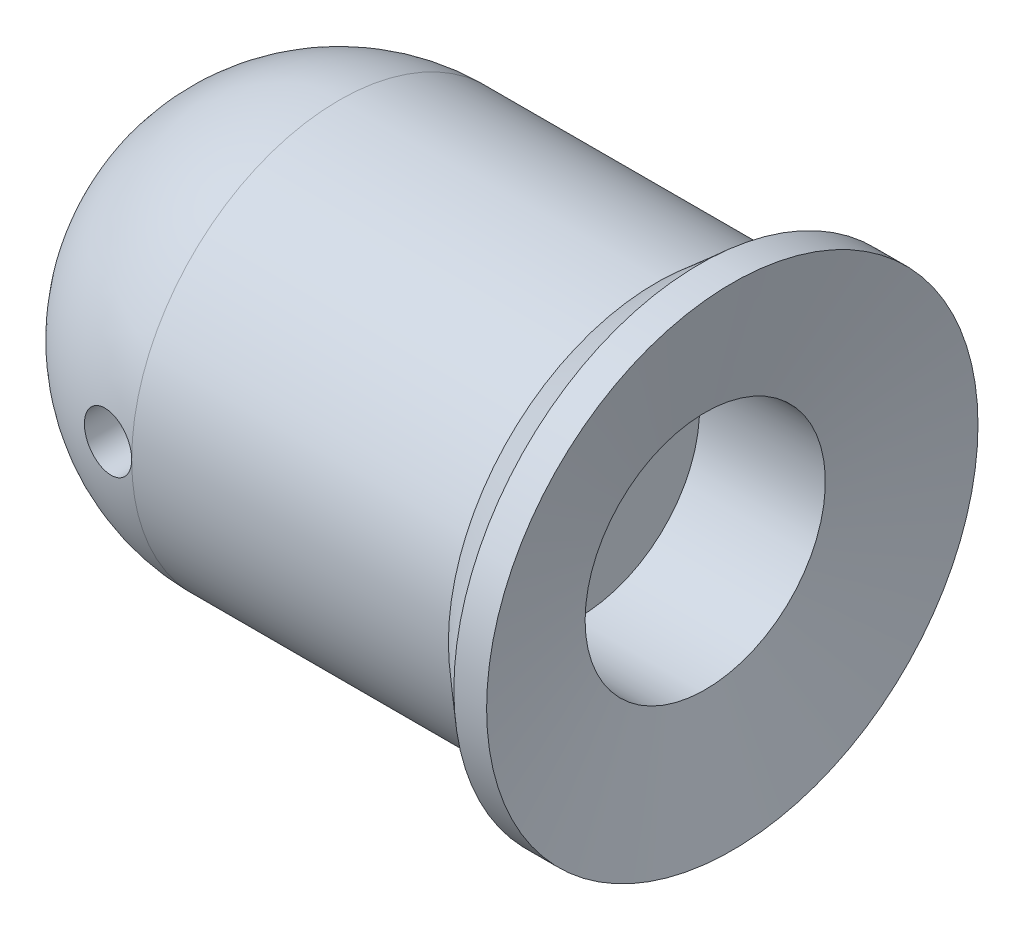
ISO-10303-21;
HEADER;
FILE_DESCRIPTION(('STEP AP214'),'2;1');
FILE_NAME('part.step','',(''),(''),'','','');
FILE_SCHEMA(('AUTOMOTIVE_DESIGN { 1 0 10303 214 1 1 1 1 }'));
ENDSEC;
DATA;
#1=APPLICATION_CONTEXT('core data for automotive mechanical design processes');
#2=APPLICATION_PROTOCOL_DEFINITION('international standard','automotive_design',2000,#1);
#3=PRODUCT_CONTEXT('',#1,'mechanical');
#4=PRODUCT('Part','Part','',(#3));
#5=PRODUCT_RELATED_PRODUCT_CATEGORY('part','',(#4));
#6=PRODUCT_DEFINITION_FORMATION('','',#4);
#7=PRODUCT_DEFINITION_CONTEXT('part definition',#1,'design');
#8=PRODUCT_DEFINITION('design','',#6,#7);
#9=PRODUCT_DEFINITION_SHAPE('','',#8);
#10=(LENGTH_UNIT() NAMED_UNIT(*) SI_UNIT(.MILLI.,.METRE.));
#11=(NAMED_UNIT(*) PLANE_ANGLE_UNIT() SI_UNIT($,.RADIAN.));
#12=(NAMED_UNIT(*) SI_UNIT($,.STERADIAN.) SOLID_ANGLE_UNIT());
#13=UNCERTAINTY_MEASURE_WITH_UNIT(LENGTH_MEASURE(1.E-05),#10,'distance_accuracy_value','');
#14=(GEOMETRIC_REPRESENTATION_CONTEXT(3) GLOBAL_UNCERTAINTY_ASSIGNED_CONTEXT((#13)) GLOBAL_UNIT_ASSIGNED_CONTEXT((#10,
#11,#12)) REPRESENTATION_CONTEXT('',''));
#15=CARTESIAN_POINT('',(0.,0.,0.));
#16=DIRECTION('',(0.,0.,1.));
#17=DIRECTION('',(1.,0.,0.));
#18=AXIS2_PLACEMENT_3D('',#15,#16,#17);
#19=CARTESIAN_POINT('',(0.,0.,0.));
#20=DIRECTION('',(-1.,0.,0.));
#21=DIRECTION('',(0.,1.,0.));
#22=AXIS2_PLACEMENT_3D('',#19,#20,#21);
#23=SPHERICAL_SURFACE('',#22,19.);
#24=CARTESIAN_POINT('',(0.,0.,0.));
#25=DIRECTION('',(-1.,0.,0.));
#26=DIRECTION('',(0.,0.,1.));
#27=AXIS2_PLACEMENT_3D('',#24,#25,#26);
#28=CIRCLE('',#27,19.);
#29=CARTESIAN_POINT('',(0.,0.,19.));
#30=VERTEX_POINT('',#29);
#31=CARTESIAN_POINT('',(0.,0.,-19.));
#32=VERTEX_POINT('',#31);
#33=EDGE_CURVE('E103',#30,#32,#28,.T.);
#34=ORIENTED_EDGE('',*,*,#33,.T.);
#35=CARTESIAN_POINT('',(-4.60444043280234,-1.34956676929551,-18.3841724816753));
#36=CARTESIAN_POINT('',(-4.52839424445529,-1.46813695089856,-18.3945137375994));
#37=CARTESIAN_POINT('',(-4.44229795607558,-1.5802722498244,-18.4062129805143));
#38=CARTESIAN_POINT('',(-4.25255463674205,-1.78841657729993,-18.4319665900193));
#39=CARTESIAN_POINT('',(-4.14888480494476,-1.88440432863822,-18.4460240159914));
#40=CARTESIAN_POINT('',(-3.92715390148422,-2.05742087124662,-18.476050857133));
#41=CARTESIAN_POINT('',(-3.80910520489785,-2.13446579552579,-18.492018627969));
#42=CARTESIAN_POINT('',(-3.56195909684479,-2.26758532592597,-18.5254010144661));
#43=CARTESIAN_POINT('',(-3.43286443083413,-2.32366512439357,-18.5428152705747));
#44=CARTESIAN_POINT('',(-3.16638087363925,-2.41367750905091,-18.5787087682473));
#45=CARTESIAN_POINT('',(-3.02894449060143,-2.44746709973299,-18.5971940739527));
#46=CARTESIAN_POINT('',(-2.75039506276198,-2.4914224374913,-18.6346015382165));
#47=CARTESIAN_POINT('',(-2.60928173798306,-2.50158638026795,-18.6535237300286));
#48=CARTESIAN_POINT('',(-2.3266061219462,-2.49800261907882,-18.6913704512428));
#49=CARTESIAN_POINT('',(-2.18504532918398,-2.48412989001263,-18.7102944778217));
#50=CARTESIAN_POINT('',(-1.90623298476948,-2.43259919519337,-18.7475113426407));
#51=CARTESIAN_POINT('',(-1.76898145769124,-2.39494109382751,-18.7658041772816));
#52=CARTESIAN_POINT('',(-1.50275057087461,-2.29686983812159,-18.8012382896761));
#53=CARTESIAN_POINT('',(-1.37376866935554,-2.23646371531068,-18.8183799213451));
#54=CARTESIAN_POINT('',(-1.12776084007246,-2.09454600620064,-18.8510334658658));
#55=CARTESIAN_POINT('',(-1.0107345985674,-2.01303497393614,-18.8665454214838));
#56=CARTESIAN_POINT('',(-0.792684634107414,-1.83168504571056,-18.895417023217));
#57=CARTESIAN_POINT('',(-0.691574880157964,-1.73195145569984,-18.9087882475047));
#58=CARTESIAN_POINT('',(-0.50755800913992,-1.51664965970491,-18.9331021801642));
#59=CARTESIAN_POINT('',(-0.424650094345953,-1.40108214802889,-18.9440449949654));
#60=CARTESIAN_POINT('',(-0.280131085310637,-1.15842887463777,-18.963107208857));
#61=CARTESIAN_POINT('',(-0.218347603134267,-1.03144757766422,-18.9712494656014));
#62=CARTESIAN_POINT('',(-0.116975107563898,-0.768770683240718,-18.9846034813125));
#63=CARTESIAN_POINT('',(-0.0773850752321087,-0.633075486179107,-18.9898153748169));
#64=CARTESIAN_POINT('',(-0.0218045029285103,-0.35791305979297,-18.9971311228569));
#65=CARTESIAN_POINT('',(-0.00563980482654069,-0.218481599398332,-18.9992579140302));
#66=CARTESIAN_POINT('',(0.00316333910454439,0.0611331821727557,-19.0004162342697));
#67=CARTESIAN_POINT('',(-0.00419759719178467,0.201316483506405,-18.9994478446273));
#68=CARTESIAN_POINT('',(-0.0421579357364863,0.477952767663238,-18.9944522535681));
#69=CARTESIAN_POINT('',(-0.0726778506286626,0.614416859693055,-18.9904355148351));
#70=CARTESIAN_POINT('',(-0.155953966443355,0.880255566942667,-18.979469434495));
#71=CARTESIAN_POINT('',(-0.208710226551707,1.00963016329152,-18.9725200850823));
#72=CARTESIAN_POINT('',(-0.335033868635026,1.25791992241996,-18.9558671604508));
#73=CARTESIAN_POINT('',(-0.408643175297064,1.3768133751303,-18.9461580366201));
#74=CARTESIAN_POINT('',(-0.574481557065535,1.60055342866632,-18.9242625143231));
#75=CARTESIAN_POINT('',(-0.666711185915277,1.70539961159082,-18.9120760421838));
#76=CARTESIAN_POINT('',(-0.867805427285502,1.89882370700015,-18.8854745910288));
#77=CARTESIAN_POINT('',(-0.976775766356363,1.98728973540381,-18.8710454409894));
#78=CARTESIAN_POINT('',(-1.20778486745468,2.14469540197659,-18.8404169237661));
#79=CARTESIAN_POINT('',(-1.32982420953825,2.21363417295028,-18.8242174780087));
#80=CARTESIAN_POINT('',(-1.58460942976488,2.33063852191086,-18.7903496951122));
#81=CARTESIAN_POINT('',(-1.7174369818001,2.37852300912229,-18.7726701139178));
#82=CARTESIAN_POINT('',(-1.9891391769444,2.4512859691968,-18.7364519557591));
#83=CARTESIAN_POINT('',(-2.12801407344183,2.47616347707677,-18.7179133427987));
#84=CARTESIAN_POINT('',(-2.40887022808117,2.50234279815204,-18.680364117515));
#85=CARTESIAN_POINT('',(-2.55086611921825,2.50348448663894,-18.661351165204));
#86=CARTESIAN_POINT('',(-2.83303593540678,2.481755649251,-18.6235114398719));
#87=CARTESIAN_POINT('',(-2.97320982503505,2.45888465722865,-18.6046846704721));
#88=CARTESIAN_POINT('',(-3.24805224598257,2.38967379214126,-18.5677161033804));
#89=CARTESIAN_POINT('',(-3.3827087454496,2.34328530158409,-18.5495758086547));
#90=CARTESIAN_POINT('',(-3.64234575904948,2.22827397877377,-18.5145504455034));
#91=CARTESIAN_POINT('',(-3.76732636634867,2.15965136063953,-18.4976653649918));
#92=CARTESIAN_POINT('',(-4.00354604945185,2.00235132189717,-18.4657121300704));
#93=CARTESIAN_POINT('',(-4.11483402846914,1.91374867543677,-18.4506375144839));
#94=CARTESIAN_POINT('',(-4.32093802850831,1.71880832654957,-18.4226899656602));
#95=CARTESIAN_POINT('',(-4.41575468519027,1.6124713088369,-18.4098169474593));
#96=CARTESIAN_POINT('',(-4.58540913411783,1.38597651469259,-18.386763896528));
#97=CARTESIAN_POINT('',(-4.66039969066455,1.26593527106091,-18.3765632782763));
#98=CARTESIAN_POINT('',(-4.78913822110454,1.01476908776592,-18.3590409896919));
#99=CARTESIAN_POINT('',(-4.84288812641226,0.883645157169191,-18.3517190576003));
#100=CARTESIAN_POINT('',(-4.92714799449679,0.615273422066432,-18.3402369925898));
#101=CARTESIAN_POINT('',(-4.95785829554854,0.478089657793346,-18.3360496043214));
#102=CARTESIAN_POINT('',(-4.99589010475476,0.200421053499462,-18.3308634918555));
#103=CARTESIAN_POINT('',(-5.00320656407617,0.0599355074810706,-18.3298654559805));
#104=CARTESIAN_POINT('',(-4.99424496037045,-0.219555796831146,-18.3310876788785));
#105=CARTESIAN_POINT('',(-4.97808309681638,-0.358565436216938,-18.3332920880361));
#106=CARTESIAN_POINT('',(-4.9228634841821,-0.631749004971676,-18.3408205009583));
#107=CARTESIAN_POINT('',(-4.88383390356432,-0.765928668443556,-18.3461406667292));
#108=CARTESIAN_POINT('',(-4.80355682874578,-0.975125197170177,-18.3570758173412));
#109=CARTESIAN_POINT('',(-4.76907429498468,-1.05285746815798,-18.3617715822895));
#110=CARTESIAN_POINT('',(-4.6924239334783,-1.20436063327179,-18.3722047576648));
#111=CARTESIAN_POINT('',(-4.65025613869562,-1.27813154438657,-18.3779421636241));
#112=CARTESIAN_POINT('',(-4.60444043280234,-1.34956676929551,-18.3841724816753));
#113=B_SPLINE_CURVE_WITH_KNOTS('',3,(#35,#36,#37,#38,#39,#40,#41,#42,#43,#44,#45,#46,#47,#48,
#49,#50,#51,#52,#53,#54,#55,#56,#57,#58,#59,#60,#61,#62,#63,#64,#65,#66,#67,#68,#69,#70,#71,#72,
#73,#74,#75,#76,#77,#78,#79,#80,#81,#82,#83,#84,#85,#86,#87,#88,#89,#90,#91,#92,#93,#94,#95,#96,
#97,#98,#99,#100,#101,#102,#103,#104,#105,#106,#107,#108,#109,#110,#111,#112),.UNSPECIFIED.,.T.,
.F.,(4,2,2,2,2,2,2,2,2,2,2,2,2,2,2,2,2,2,2,2,2,2,2,2,2,2,2,2,2,2,2,2,2,2,2,2,2,2,4),(0.,
0.423407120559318,0.847367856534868,1.27096625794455,1.69445967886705,2.12064412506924,
2.54686111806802,2.97530171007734,3.40374474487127,3.832055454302,4.26035492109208,
4.6862533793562,5.11213316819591,5.53444958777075,5.95674661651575,6.37588763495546,
6.79501764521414,7.21271556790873,7.63041460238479,8.04895944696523,8.4675167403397,
8.88883524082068,9.31017244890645,9.73506593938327,10.1599772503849,10.5877541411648,
11.0155393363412,11.4442125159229,11.8728815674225,12.2999722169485,12.7270463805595,
13.1507270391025,13.5743691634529,13.9942834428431,14.4142883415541,14.8322216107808,
15.2496411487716,15.5047332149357,15.7598241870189),.UNSPECIFIED.);
#114=EDGE_CURVE('E56',#32,#32,#113,.T.);
#115=ORIENTED_EDGE('',*,*,#114,.T.);
#116=EDGE_CURVE('E98',#32,#30,#28,.T.);
#117=ORIENTED_EDGE('',*,*,#116,.T.);
#118=CARTESIAN_POINT('',(-4.60444043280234,-1.34956676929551,18.3841724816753));
#119=CARTESIAN_POINT('',(-4.67958474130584,-1.23237975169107,18.37395387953));
#120=CARTESIAN_POINT('',(-4.74502260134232,-1.10873913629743,18.3650467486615));
#121=CARTESIAN_POINT('',(-4.85447395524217,-0.852034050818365,18.3501413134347));
#122=CARTESIAN_POINT('',(-4.89846369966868,-0.718959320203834,18.3441462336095));
#123=CARTESIAN_POINT('',(-4.96362835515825,-0.447257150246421,18.335263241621));
#124=CARTESIAN_POINT('',(-4.98480900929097,-0.308631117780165,18.3323745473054));
#125=CARTESIAN_POINT('',(-5.00372468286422,-0.0297940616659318,18.3297948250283));
#126=CARTESIAN_POINT('',(-5.00146526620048,0.11041657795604,18.330103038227));
#127=CARTESIAN_POINT('',(-4.97362555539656,0.388052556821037,18.3338996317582));
#128=CARTESIAN_POINT('',(-4.94811189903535,0.525484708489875,18.3373789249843));
#129=CARTESIAN_POINT('',(-4.87461801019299,0.794089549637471,18.347395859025));
#130=CARTESIAN_POINT('',(-4.82663698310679,0.925262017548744,18.3539336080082));
#131=CARTESIAN_POINT('',(-4.7095354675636,1.17786411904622,18.3698771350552));
#132=CARTESIAN_POINT('',(-4.6403818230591,1.29927809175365,18.3792874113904));
#133=CARTESIAN_POINT('',(-4.48298440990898,1.52876909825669,18.4006845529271));
#134=CARTESIAN_POINT('',(-4.39474009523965,1.63684575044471,18.412671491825));
#135=CARTESIAN_POINT('',(-4.20104380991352,1.83739358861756,18.4389520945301));
#136=CARTESIAN_POINT('',(-4.09547939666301,1.92975418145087,18.4532608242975));
#137=CARTESIAN_POINT('',(-3.87059343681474,2.09546779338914,18.4837026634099));
#138=CARTESIAN_POINT('',(-3.75127127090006,2.16881995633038,18.4998358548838));
#139=CARTESIAN_POINT('',(-3.50112170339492,2.29511635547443,18.5336094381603));
#140=CARTESIAN_POINT('',(-3.37020175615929,2.34787407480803,18.5512619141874));
#141=CARTESIAN_POINT('',(-3.10147190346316,2.43063789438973,18.5874411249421));
#142=CARTESIAN_POINT('',(-2.96366169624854,2.46064299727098,18.6059678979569));
#143=CARTESIAN_POINT('',(-2.68402640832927,2.49722963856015,18.6435034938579));
#144=CARTESIAN_POINT('',(-2.54217994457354,2.50364537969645,18.6625147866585));
#145=CARTESIAN_POINT('',(-2.25941588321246,2.49241664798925,18.70035504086));
#146=CARTESIAN_POINT('',(-2.11849830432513,2.47477169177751,18.7191839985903));
#147=CARTESIAN_POINT('',(-1.8412839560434,2.41582613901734,18.7561702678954));
#148=CARTESIAN_POINT('',(-1.70499773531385,2.37447493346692,18.7743260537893));
#149=CARTESIAN_POINT('',(-1.44127124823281,2.26919617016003,18.8094112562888));
#150=CARTESIAN_POINT('',(-1.31383088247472,2.20526886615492,18.8263406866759));
#151=CARTESIAN_POINT('',(-1.07192620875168,2.05685903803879,18.858436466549));
#152=CARTESIAN_POINT('',(-0.957417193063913,1.97245072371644,18.8736088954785));
#153=CARTESIAN_POINT('',(-0.74420562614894,1.78530232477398,18.9018298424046));
#154=CARTESIAN_POINT('',(-0.645502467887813,1.68256294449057,18.9148784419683));
#155=CARTESIAN_POINT('',(-0.467520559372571,1.46249844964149,18.9383878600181));
#156=CARTESIAN_POINT('',(-0.388099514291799,1.34529045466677,18.9488676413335));
#157=CARTESIAN_POINT('',(-0.250083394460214,1.09899914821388,18.9670679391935));
#158=CARTESIAN_POINT('',(-0.191487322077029,0.969916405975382,18.974788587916));
#159=CARTESIAN_POINT('',(-0.0972829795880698,0.70469282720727,18.9871963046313));
#160=CARTESIAN_POINT('',(-0.0614879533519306,0.56861946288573,18.991908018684));
#161=CARTESIAN_POINT('',(-0.0131933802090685,0.29233119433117,18.9982642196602));
#162=CARTESIAN_POINT('',(-0.000692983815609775,0.152116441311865,18.9999088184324));
#163=CARTESIAN_POINT('',(0.000633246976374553,-0.127663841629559,19.0000833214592));
#164=CARTESIAN_POINT('',(-0.0104130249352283,-0.267228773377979,18.9986300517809));
#165=CARTESIAN_POINT('',(-0.0555890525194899,-0.542502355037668,18.9926844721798));
#166=CARTESIAN_POINT('',(-0.0897185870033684,-0.678211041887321,18.9881921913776));
#167=CARTESIAN_POINT('',(-0.180032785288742,-0.941896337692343,18.976297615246));
#168=CARTESIAN_POINT('',(-0.236211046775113,-1.06987517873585,18.9688961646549));
#169=CARTESIAN_POINT('',(-0.368969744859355,-1.31456692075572,18.9513911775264));
#170=CARTESIAN_POINT('',(-0.445550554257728,-1.43127961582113,18.941287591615));
#171=CARTESIAN_POINT('',(-0.617314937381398,-1.65076067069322,18.918603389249));
#172=CARTESIAN_POINT('',(-0.712588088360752,-1.75345767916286,18.9060108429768));
#173=CARTESIAN_POINT('',(-0.918748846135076,-1.94141838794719,18.8787298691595));
#174=CARTESIAN_POINT('',(-1.02963710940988,-2.02668135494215,18.8640413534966));
#175=CARTESIAN_POINT('',(-1.2648330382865,-2.17809087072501,18.8328457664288));
#176=CARTESIAN_POINT('',(-1.38924185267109,-2.2440774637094,18.8163249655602));
#177=CARTESIAN_POINT('',(-1.64720737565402,-2.35423400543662,18.7820195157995));
#178=CARTESIAN_POINT('',(-1.78076451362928,-2.39840292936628,18.7642348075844));
#179=CARTESIAN_POINT('',(-2.05436685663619,-2.46401234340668,18.7277468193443));
#180=CARTESIAN_POINT('',(-2.19445500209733,-2.48527041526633,18.7090373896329));
#181=CARTESIAN_POINT('',(-2.47617126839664,-2.50386908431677,18.6713550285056));
#182=CARTESIAN_POINT('',(-2.6177993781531,-2.50120985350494,18.6523820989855));
#183=CARTESIAN_POINT('',(-2.89920929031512,-2.47198855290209,18.6146262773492));
#184=CARTESIAN_POINT('',(-3.03898082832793,-2.44532604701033,18.5958445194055));
#185=CARTESIAN_POINT('',(-3.31212644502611,-2.36866493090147,18.5590868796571));
#186=CARTESIAN_POINT('',(-3.44549892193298,-2.31866051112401,18.5411111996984));
#187=CARTESIAN_POINT('',(-3.7018654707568,-2.19673827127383,18.5065116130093));
#188=CARTESIAN_POINT('',(-3.82486784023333,-2.12483818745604,18.4898866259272));
#189=CARTESIAN_POINT('',(-4.05694096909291,-1.96113514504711,18.4584815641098));
#190=CARTESIAN_POINT('',(-4.16602867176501,-1.86935676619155,18.4436992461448));
#191=CARTESIAN_POINT('',(-4.33014913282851,-1.70547734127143,18.4214366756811));
#192=CARTESIAN_POINT('',(-4.39032028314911,-1.63852881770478,18.4132685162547));
#193=CARTESIAN_POINT('',(-4.50316161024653,-1.4984759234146,18.3979414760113));
#194=CARTESIAN_POINT('',(-4.5558318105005,-1.42537157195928,18.3907825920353));
#195=CARTESIAN_POINT('',(-4.60444043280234,-1.34956676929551,18.3841724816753));
#196=B_SPLINE_CURVE_WITH_KNOTS('',3,(#118,#119,#120,#121,#122,#123,#124,#125,#126,#127,#128,
#129,#130,#131,#132,#133,#134,#135,#136,#137,#138,#139,#140,#141,#142,#143,#144,#145,#146,#147,
#148,#149,#150,#151,#152,#153,#154,#155,#156,#157,#158,#159,#160,#161,#162,#163,#164,#165,#166,
#167,#168,#169,#170,#171,#172,#173,#174,#175,#176,#177,#178,#179,#180,#181,#182,#183,#184,#185,
#186,#187,#188,#189,#190,#191,#192,#193,#194,#195),.UNSPECIFIED.,.T.,.F.,(4,2,2,2,2,2,2,2,2,2,2,
2,2,2,2,2,2,2,2,2,2,2,2,2,2,2,2,2,2,2,2,2,2,2,2,2,2,2,4),(0.,0.418427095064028,
0.837316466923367,1.25610034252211,1.6747848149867,2.09227325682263,2.50977646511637,
2.92793685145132,3.34610919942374,3.76711234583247,4.1881344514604,4.61288573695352,
5.03765564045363,5.46540538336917,5.89316371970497,6.32183866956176,6.75050880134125,
7.177648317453,7.60477142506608,8.02863956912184,8.45248740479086,8.87281741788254,
9.29313210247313,9.71116966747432,10.1292032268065,10.547115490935,10.9650353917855,
11.3850092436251,11.8050007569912,12.2283843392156,12.651787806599,13.0785380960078,
13.5052853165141,13.9338265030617,14.3624744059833,14.7907760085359,15.2185510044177,
15.4892199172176,15.7598879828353),.UNSPECIFIED.);
#197=EDGE_CURVE('E61',#30,#30,#196,.T.);
#198=ORIENTED_EDGE('',*,*,#197,.T.);
#199=EDGE_LOOP('',(#34,#115,#117,#198));
#200=FACE_BOUND('',#199,.T.);
#201=ADVANCED_FACE('F38',(#200),#23,.T.);
#202=CARTESIAN_POINT('',(22.,11.,0.));
#203=DIRECTION('',(-1.,0.,0.));
#204=DIRECTION('',(0.,0.,1.));
#205=AXIS2_PLACEMENT_3D('',#202,#203,#204);
#206=PLANE('',#205);
#207=CARTESIAN_POINT('',(22.,0.,0.));
#208=DIRECTION('',(1.,0.,0.));
#209=DIRECTION('',(0.,0.,-1.));
#210=AXIS2_PLACEMENT_3D('',#207,#208,#209);
#211=CIRCLE('',#210,4.25);
#212=CARTESIAN_POINT('',(22.,0.,-4.25));
#213=VERTEX_POINT('',#212);
#214=EDGE_CURVE('E96',#213,#213,#211,.T.);
#215=ORIENTED_EDGE('',*,*,#214,.F.);
#216=EDGE_LOOP('',(#215));
#217=FACE_BOUND('',#216,.T.);
#218=CARTESIAN_POINT('',(22.,0.,0.));
#219=DIRECTION('',(-1.,0.,0.));
#220=DIRECTION('',(0.,0.,1.));
#221=AXIS2_PLACEMENT_3D('',#218,#219,#220);
#222=CIRCLE('',#221,11.);
#223=CARTESIAN_POINT('',(22.,0.,11.));
#224=VERTEX_POINT('',#223);
#225=EDGE_CURVE('E85',#224,#224,#222,.T.);
#226=ORIENTED_EDGE('',*,*,#225,.F.);
#227=EDGE_LOOP('',(#226));
#228=FACE_BOUND('',#227,.T.);
#229=ADVANCED_FACE('F177',(#217,#228),#206,.F.);
#230=CARTESIAN_POINT('',(0.,0.,0.));
#231=DIRECTION('',(-1.,0.,0.));
#232=DIRECTION('',(0.,0.,1.));
#233=AXIS2_PLACEMENT_3D('',#230,#231,#232);
#234=CYLINDRICAL_SURFACE('',#233,11.);
#235=CARTESIAN_POINT('',(33.52,0.,0.));
#236=DIRECTION('',(-1.,0.,0.));
#237=DIRECTION('',(0.,0.,1.));
#238=AXIS2_PLACEMENT_3D('',#235,#236,#237);
#239=CIRCLE('',#238,11.);
#240=CARTESIAN_POINT('',(33.52,0.,11.));
#241=VERTEX_POINT('',#240);
#242=EDGE_CURVE('E115',#241,#241,#239,.T.);
#243=ORIENTED_EDGE('',*,*,#242,.F.);
#244=EDGE_LOOP('',(#243));
#245=FACE_BOUND('',#244,.T.);
#246=ORIENTED_EDGE('',*,*,#225,.T.);
#247=EDGE_LOOP('',(#246));
#248=FACE_BOUND('',#247,.T.);
#249=ADVANCED_FACE('F171',(#245,#248),#234,.F.);
#250=CARTESIAN_POINT('',(33.52,0.,0.));
#251=DIRECTION('',(1.,0.,0.));
#252=DIRECTION('',(0.,0.,-1.));
#253=AXIS2_PLACEMENT_3D('',#250,#251,#252);
#254=CONICAL_SURFACE('',#253,11.,1.35839689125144);
#255=CARTESIAN_POINT('',(36.,0.,0.));
#256=DIRECTION('',(-1.,0.,0.));
#257=DIRECTION('',(0.,0.,1.));
#258=AXIS2_PLACEMENT_3D('',#255,#256,#257);
#259=CIRCLE('',#258,22.5);
#260=CARTESIAN_POINT('',(36.,0.,22.5));
#261=VERTEX_POINT('',#260);
#262=EDGE_CURVE('E112',#261,#261,#259,.T.);
#263=ORIENTED_EDGE('',*,*,#262,.F.);
#264=EDGE_LOOP('',(#263));
#265=FACE_BOUND('',#264,.T.);
#266=ORIENTED_EDGE('',*,*,#242,.T.);
#267=EDGE_LOOP('',(#266));
#268=FACE_BOUND('',#267,.T.);
#269=ADVANCED_FACE('F165',(#265,#268),#254,.F.);
#270=CARTESIAN_POINT('',(0.,0.,0.));
#271=DIRECTION('',(-1.,0.,0.));
#272=DIRECTION('',(0.,0.,1.));
#273=AXIS2_PLACEMENT_3D('',#270,#271,#272);
#274=CYLINDRICAL_SURFACE('',#273,22.5);
#275=CARTESIAN_POINT('',(33.,0.,0.));
#276=DIRECTION('',(-1.,0.,0.));
#277=DIRECTION('',(0.,0.,1.));
#278=AXIS2_PLACEMENT_3D('',#275,#276,#277);
#279=CIRCLE('',#278,22.5);
#280=CARTESIAN_POINT('',(33.,0.,22.5));
#281=VERTEX_POINT('',#280);
#282=EDGE_CURVE('E109',#281,#281,#279,.T.);
#283=ORIENTED_EDGE('',*,*,#282,.F.);
#284=EDGE_LOOP('',(#283));
#285=FACE_BOUND('',#284,.T.);
#286=ORIENTED_EDGE('',*,*,#262,.T.);
#287=EDGE_LOOP('',(#286));
#288=FACE_BOUND('',#287,.T.);
#289=ADVANCED_FACE('F159',(#285,#288),#274,.T.);
#290=CARTESIAN_POINT('',(33.,0.,0.));
#291=DIRECTION('',(1.,0.,0.));
#292=DIRECTION('',(0.,0.,-1.));
#293=AXIS2_PLACEMENT_3D('',#290,#291,#292);
#294=CONICAL_SURFACE('',#293,22.5,0.718829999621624);
#295=CARTESIAN_POINT('',(29.,0.,0.));
#296=DIRECTION('',(-1.,0.,0.));
#297=DIRECTION('',(0.,0.,1.));
#298=AXIS2_PLACEMENT_3D('',#295,#296,#297);
#299=CIRCLE('',#298,19.);
#300=CARTESIAN_POINT('',(29.,0.,19.));
#301=VERTEX_POINT('',#300);
#302=EDGE_CURVE('E106',#301,#301,#299,.T.);
#303=ORIENTED_EDGE('',*,*,#302,.F.);
#304=EDGE_LOOP('',(#303));
#305=FACE_BOUND('',#304,.T.);
#306=ORIENTED_EDGE('',*,*,#282,.T.);
#307=EDGE_LOOP('',(#306));
#308=FACE_BOUND('',#307,.T.);
#309=ADVANCED_FACE('F153',(#305,#308),#294,.T.);
#310=CARTESIAN_POINT('',(0.,0.,0.));
#311=DIRECTION('',(-1.,0.,0.));
#312=DIRECTION('',(0.,0.,1.));
#313=AXIS2_PLACEMENT_3D('',#310,#311,#312);
#314=CYLINDRICAL_SURFACE('',#313,19.);
#315=ORIENTED_EDGE('',*,*,#33,.F.);
#316=ORIENTED_EDGE('',*,*,#116,.F.);
#317=EDGE_LOOP('',(#315,#316));
#318=FACE_BOUND('',#317,.T.);
#319=ORIENTED_EDGE('',*,*,#302,.T.);
#320=EDGE_LOOP('',(#319));
#321=FACE_BOUND('',#320,.T.);
#322=ADVANCED_FACE('F150',(#318,#321),#314,.T.);
#323=CARTESIAN_POINT('',(-3.,0.,0.));
#324=DIRECTION('',(1.,0.,0.));
#325=DIRECTION('',(0.,0.,-1.));
#326=AXIS2_PLACEMENT_3D('',#323,#324,#325);
#327=CONICAL_SURFACE('',#326,4.24999999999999,1.02974425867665);
#328=CARTESIAN_POINT('',(-5.55365763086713,0.,0.));
#329=VERTEX_POINT('',#328);
#330=VERTEX_LOOP('',#329);
#331=FACE_BOUND('',#330,.T.);
#332=CARTESIAN_POINT('',(-3.,0.,0.));
#333=DIRECTION('',(1.,0.,0.));
#334=DIRECTION('',(0.,0.,-1.));
#335=AXIS2_PLACEMENT_3D('',#332,#333,#334);
#336=CIRCLE('',#335,4.24999999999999);
#337=CARTESIAN_POINT('',(-3.,2.44948974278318,-3.47311099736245));
#338=VERTEX_POINT('',#337);
#339=CARTESIAN_POINT('',(-3.,2.44948974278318,3.47311099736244));
#340=VERTEX_POINT('',#339);
#341=EDGE_CURVE('E91',#338,#340,#336,.T.);
#342=ORIENTED_EDGE('',*,*,#341,.T.);
#343=CARTESIAN_POINT('',(-2.7998,2.48195889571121,3.8529857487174));
#344=CARTESIAN_POINT('',(-2.84766569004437,2.47617168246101,3.76195460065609));
#345=CARTESIAN_POINT('',(-2.89554895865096,2.46898821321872,3.67101921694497));
#346=CARTESIAN_POINT('',(-2.99135063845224,2.45172404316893,3.48942373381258));
#347=CARTESIAN_POINT('',(-3.03926905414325,2.44164286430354,3.3987636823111));
#348=CARTESIAN_POINT('',(-3.1353587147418,2.41842397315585,3.21739198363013));
#349=CARTESIAN_POINT('',(-3.183530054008,2.40527160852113,3.126682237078));
#350=CARTESIAN_POINT('',(-3.27988509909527,2.37577598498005,2.94580690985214));
#351=CARTESIAN_POINT('',(-3.3280688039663,2.35943292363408,2.85564129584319));
#352=CARTESIAN_POINT('',(-3.47392942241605,2.3048618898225,2.58377022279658));
#353=CARTESIAN_POINT('',(-3.57165878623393,2.26138530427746,2.40307095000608));
#354=CARTESIAN_POINT('',(-3.71841581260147,2.18368871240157,2.1360159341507));
#355=CARTESIAN_POINT('',(-3.76731828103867,2.15574004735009,2.04774022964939));
#356=CARTESIAN_POINT('',(-3.86531768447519,2.09505139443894,1.87297159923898));
#357=CARTESIAN_POINT('',(-3.91441454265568,2.06231314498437,1.78647803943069));
#358=CARTESIAN_POINT('',(-3.98739445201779,2.00960400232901,1.66035873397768));
#359=CARTESIAN_POINT('',(-4.0111279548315,1.99183410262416,1.61972447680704));
#360=CARTESIAN_POINT('',(-4.05872567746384,1.95480987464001,1.53921480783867));
#361=CARTESIAN_POINT('',(-4.08258991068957,1.93555539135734,1.4993394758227));
#362=CARTESIAN_POINT('',(-4.15449580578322,1.87525562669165,1.38102480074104));
#363=CARTESIAN_POINT('',(-4.20281140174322,1.83170190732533,1.30396543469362));
#364=CARTESIAN_POINT('',(-4.29170769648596,1.74439825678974,1.16996434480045));
#365=CARTESIAN_POINT('',(-4.33208403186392,1.70214573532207,1.11192320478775));
#366=CARTESIAN_POINT('',(-4.41405842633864,1.60941230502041,1.00367218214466));
#367=CARTESIAN_POINT('',(-4.45565194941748,1.55895937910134,0.953436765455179));
#368=CARTESIAN_POINT('',(-4.52265083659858,1.46989278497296,0.885266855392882));
#369=CARTESIAN_POINT('',(-4.5477474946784,1.43483018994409,0.862510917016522));
#370=CARTESIAN_POINT('',(-4.5976332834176,1.36084831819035,0.824427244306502));
#371=CARTESIAN_POINT('',(-4.62242330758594,1.32194809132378,0.80906484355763));
#372=CARTESIAN_POINT('',(-4.67077856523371,1.2409443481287,0.786899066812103));
#373=CARTESIAN_POINT('',(-4.69434086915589,1.19883371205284,0.780115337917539));
#374=CARTESIAN_POINT('',(-4.73923714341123,1.11274284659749,0.774231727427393));
#375=CARTESIAN_POINT('',(-4.76055797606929,1.06875351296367,0.775174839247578));
#376=CARTESIAN_POINT('',(-4.80605084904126,0.967487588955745,0.783265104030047));
#377=CARTESIAN_POINT('',(-4.82932155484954,0.909974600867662,0.792092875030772));
#378=CARTESIAN_POINT('',(-4.87140848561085,0.793884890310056,0.813184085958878));
#379=CARTESIAN_POINT('',(-4.89021194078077,0.735305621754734,0.825457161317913));
#380=CARTESIAN_POINT('',(-4.92349343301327,0.616818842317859,0.849911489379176));
#381=CARTESIAN_POINT('',(-4.93796599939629,0.55690975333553,0.862092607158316));
#382=CARTESIAN_POINT('',(-4.96250416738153,0.435759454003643,0.8839860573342));
#383=CARTESIAN_POINT('',(-4.97257237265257,0.374519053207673,0.893699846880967));
#384=CARTESIAN_POINT('',(-4.98678177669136,0.261819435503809,0.907772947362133));
#385=CARTESIAN_POINT('',(-4.99165390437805,0.210533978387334,0.912773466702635));
#386=CARTESIAN_POINT('',(-4.99821980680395,0.107523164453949,0.919562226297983));
#387=CARTESIAN_POINT('',(-4.99991256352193,0.0557976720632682,0.921349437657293));
#388=CARTESIAN_POINT('',(-5.00008091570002,-0.0477223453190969,0.921525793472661));
#389=CARTESIAN_POINT('',(-4.99855292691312,-0.0995168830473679,0.919911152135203));
#390=CARTESIAN_POINT('',(-4.99230662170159,-0.202676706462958,0.913444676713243));
#391=CARTESIAN_POINT('',(-4.98758976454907,-0.254042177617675,0.908594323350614));
#392=CARTESIAN_POINT('',(-4.97301818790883,-0.372572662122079,0.894115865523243));
#393=CARTESIAN_POINT('',(-4.96199408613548,-0.439465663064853,0.883449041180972));
#394=CARTESIAN_POINT('',(-4.93467613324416,-0.571781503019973,0.859251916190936));
#395=CARTESIAN_POINT('',(-4.91836852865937,-0.637200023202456,0.84571417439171));
#396=CARTESIAN_POINT('',(-4.88065031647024,-0.766159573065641,0.819075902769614));
#397=CARTESIAN_POINT('',(-4.85927271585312,-0.829709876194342,0.80597314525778));
#398=CARTESIAN_POINT('',(-4.81115558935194,-0.955535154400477,0.785128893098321));
#399=CARTESIAN_POINT('',(-4.78444267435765,-1.01781483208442,0.777361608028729));
#400=CARTESIAN_POINT('',(-4.73483222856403,-1.12148393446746,0.774626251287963));
#401=CARTESIAN_POINT('',(-4.71330490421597,-1.16338388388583,0.776445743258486));
#402=CARTESIAN_POINT('',(-4.6684489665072,-1.24498342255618,0.787874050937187));
#403=CARTESIAN_POINT('',(-4.64512724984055,-1.28469051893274,0.797454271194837));
#404=CARTESIAN_POINT('',(-4.5976857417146,-1.36078446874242,0.824396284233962));
#405=CARTESIAN_POINT('',(-4.5735662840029,-1.39717268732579,0.84175486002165));
#406=CARTESIAN_POINT('',(-4.52526411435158,-1.46631983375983,0.882751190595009));
#407=CARTESIAN_POINT('',(-4.50108154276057,-1.49906343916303,0.906414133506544));
#408=CARTESIAN_POINT('',(-4.43275200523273,-1.5873730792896,0.98002309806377));
#409=CARTESIAN_POINT('',(-4.38904475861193,-1.63877796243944,1.0352543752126));
#410=CARTESIAN_POINT('',(-4.30287452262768,-1.733125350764,1.15331036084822));
#411=CARTESIAN_POINT('',(-4.26041670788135,-1.77603599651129,1.21616228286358));
#412=CARTESIAN_POINT('',(-4.18437802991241,-1.84798385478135,1.33371013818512));
#413=CARTESIAN_POINT('',(-4.15065494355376,-1.87810396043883,1.38766153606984));
#414=CARTESIAN_POINT('',(-4.0835588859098,-1.93501299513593,1.49751717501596));
#415=CARTESIAN_POINT('',(-4.0501860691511,-1.96180050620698,1.5534222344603));
#416=CARTESIAN_POINT('',(-3.95028710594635,-2.03806826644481,1.72338666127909));
#417=CARTESIAN_POINT('',(-3.88408959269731,-2.08335344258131,1.83952091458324));
#418=CARTESIAN_POINT('',(-3.75176615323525,-2.1654421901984,2.07545007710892));
#419=CARTESIAN_POINT('',(-3.68564192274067,-2.20220623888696,2.19525923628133));
#420=CARTESIAN_POINT('',(-3.55359978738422,-2.26834144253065,2.43683786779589));
#421=CARTESIAN_POINT('',(-3.48768174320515,-2.2977198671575,2.55860528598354));
#422=CARTESIAN_POINT('',(-3.36955689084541,-2.34457304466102,2.7781596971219));
#423=CARTESIAN_POINT('',(-3.31733878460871,-2.36325297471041,2.87568834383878));
#424=CARTESIAN_POINT('',(-3.2129110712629,-2.39682427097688,3.07142989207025));
#425=CARTESIAN_POINT('',(-3.16070146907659,-2.41171474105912,3.16964294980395));
#426=CARTESIAN_POINT('',(-3.05701492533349,-2.43773546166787,3.36521193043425));
#427=CARTESIAN_POINT('',(-3.00553769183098,-2.44891417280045,3.46256130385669));
#428=CARTESIAN_POINT('',(-2.90263358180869,-2.46791661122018,3.65756643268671));
#429=CARTESIAN_POINT('',(-2.85120669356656,-2.47574161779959,3.75522205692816));
#430=CARTESIAN_POINT('',(-2.7998,-2.48195889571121,3.8529857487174));
#431=B_SPLINE_CURVE_WITH_KNOTS('',3,(#343,#344,#345,#346,#347,#348,#349,#350,#351,#352,#353,
#354,#355,#356,#357,#358,#359,#360,#361,#362,#363,#364,#365,#366,#367,#368,#369,#370,#371,#372,
#373,#374,#375,#376,#377,#378,#379,#380,#381,#382,#383,#384,#385,#386,#387,#388,#389,#390,#391,
#392,#393,#394,#395,#396,#397,#398,#399,#400,#401,#402,#403,#404,#405,#406,#407,#408,#409,#410,
#411,#412,#413,#414,#415,#416,#417,#418,#419,#420,#421,#422,#423,#424,#425,#426,#427,#428,#429,
#430),.UNSPECIFIED.,.F.,.F.,(4,2,2,2,2,2,2,2,2,2,2,2,2,2,2,2,2,2,2,2,2,2,2,2,2,2,2,2,2,2,2,2,2,
2,2,2,2,2,2,2,2,2,2,4),(0.,0.309025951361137,0.618102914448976,0.928685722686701,
1.23924930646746,1.86848730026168,2.18254638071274,2.49649175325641,2.64736868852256,
2.79826139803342,3.10029794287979,3.3470069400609,3.59289109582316,3.73859806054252,
3.88361502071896,4.02896350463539,4.1751212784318,4.3626522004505,4.55071290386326,
4.73901016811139,4.92719596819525,5.08228880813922,5.23743129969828,5.3927465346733,
5.54799074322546,5.75352450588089,5.95959765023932,6.16436435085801,6.36813415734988,
6.50896182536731,6.64927294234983,6.78952608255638,6.93034821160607,7.19045182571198,
7.45151326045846,7.66255706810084,7.87369036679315,8.29664076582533,8.72151530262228,
9.14596998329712,9.48248741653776,9.81908435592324,10.1510959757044,10.4829808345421),.UNSPECIFIED.);
#432=CARTESIAN_POINT('',(-3.,-2.44948974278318,3.47311099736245));
#433=VERTEX_POINT('',#432);
#434=EDGE_CURVE('E80',#340,#433,#431,.T.);
#435=ORIENTED_EDGE('',*,*,#434,.T.);
#436=CARTESIAN_POINT('',(-3.,-2.44948974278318,-3.47311099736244));
#437=VERTEX_POINT('',#436);
#438=EDGE_CURVE('E90',#433,#437,#336,.T.);
#439=ORIENTED_EDGE('',*,*,#438,.T.);
#440=CARTESIAN_POINT('',(-2.7998,-2.48195889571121,-3.8529857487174));
#441=CARTESIAN_POINT('',(-2.84766569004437,-2.47617168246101,-3.76195460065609));
#442=CARTESIAN_POINT('',(-2.89554895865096,-2.46898821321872,-3.67101921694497));
#443=CARTESIAN_POINT('',(-2.99135063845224,-2.45172404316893,-3.48942373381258));
#444=CARTESIAN_POINT('',(-3.03926905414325,-2.44164286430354,-3.3987636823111));
#445=CARTESIAN_POINT('',(-3.1353587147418,-2.41842397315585,-3.21739198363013));
#446=CARTESIAN_POINT('',(-3.183530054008,-2.40527160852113,-3.126682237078));
#447=CARTESIAN_POINT('',(-3.27988509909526,-2.37577598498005,-2.94580690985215));
#448=CARTESIAN_POINT('',(-3.3280688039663,-2.35943292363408,-2.85564129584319));
#449=CARTESIAN_POINT('',(-3.47392942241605,-2.3048618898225,-2.58377022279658));
#450=CARTESIAN_POINT('',(-3.57165878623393,-2.26138530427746,-2.40307095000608));
#451=CARTESIAN_POINT('',(-3.71841581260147,-2.18368871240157,-2.13601593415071));
#452=CARTESIAN_POINT('',(-3.76731828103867,-2.15574004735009,-2.04774022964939));
#453=CARTESIAN_POINT('',(-3.86531768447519,-2.09505139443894,-1.87297159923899));
#454=CARTESIAN_POINT('',(-3.91441454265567,-2.06231314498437,-1.78647803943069));
#455=CARTESIAN_POINT('',(-3.98739445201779,-2.00960400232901,-1.66035873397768));
#456=CARTESIAN_POINT('',(-4.0111279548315,-1.99183410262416,-1.61972447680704));
#457=CARTESIAN_POINT('',(-4.05872567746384,-1.95480987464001,-1.53921480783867));
#458=CARTESIAN_POINT('',(-4.08258991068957,-1.93555539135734,-1.4993394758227));
#459=CARTESIAN_POINT('',(-4.15449580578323,-1.87525562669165,-1.38102480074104));
#460=CARTESIAN_POINT('',(-4.20281140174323,-1.83170190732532,-1.30396543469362));
#461=CARTESIAN_POINT('',(-4.29170769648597,-1.74439825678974,-1.16996434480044));
#462=CARTESIAN_POINT('',(-4.33208403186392,-1.70214573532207,-1.11192320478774));
#463=CARTESIAN_POINT('',(-4.41405842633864,-1.60941230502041,-1.00367218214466));
#464=CARTESIAN_POINT('',(-4.45565194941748,-1.55895937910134,-0.953436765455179));
#465=CARTESIAN_POINT('',(-4.52265083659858,-1.46989278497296,-0.885266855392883));
#466=CARTESIAN_POINT('',(-4.5477474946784,-1.43483018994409,-0.862510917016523));
#467=CARTESIAN_POINT('',(-4.5976332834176,-1.36084831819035,-0.824427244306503));
#468=CARTESIAN_POINT('',(-4.62242330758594,-1.32194809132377,-0.809064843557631));
#469=CARTESIAN_POINT('',(-4.67077856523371,-1.24094434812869,-0.786899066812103));
#470=CARTESIAN_POINT('',(-4.69434086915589,-1.19883371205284,-0.780115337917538));
#471=CARTESIAN_POINT('',(-4.73923714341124,-1.11274284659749,-0.774231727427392));
#472=CARTESIAN_POINT('',(-4.76055797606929,-1.06875351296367,-0.775174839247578));
#473=CARTESIAN_POINT('',(-4.80605084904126,-0.967487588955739,-0.783265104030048));
#474=CARTESIAN_POINT('',(-4.82932155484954,-0.909974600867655,-0.792092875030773));
#475=CARTESIAN_POINT('',(-4.87140848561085,-0.793884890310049,-0.81318408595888));
#476=CARTESIAN_POINT('',(-4.89021194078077,-0.735305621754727,-0.825457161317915));
#477=CARTESIAN_POINT('',(-4.92349343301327,-0.616818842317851,-0.849911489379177));
#478=CARTESIAN_POINT('',(-4.9379659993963,-0.556909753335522,-0.862092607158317));
#479=CARTESIAN_POINT('',(-4.96250416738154,-0.435759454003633,-0.883986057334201));
#480=CARTESIAN_POINT('',(-4.97257237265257,-0.374519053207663,-0.893699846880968));
#481=CARTESIAN_POINT('',(-4.98678177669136,-0.261819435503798,-0.907772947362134));
#482=CARTESIAN_POINT('',(-4.99165390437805,-0.210533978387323,-0.912773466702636));
#483=CARTESIAN_POINT('',(-4.99821980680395,-0.107523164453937,-0.919562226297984));
#484=CARTESIAN_POINT('',(-4.99991256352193,-0.0557976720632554,-0.921349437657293));
#485=CARTESIAN_POINT('',(-5.00008091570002,0.0477223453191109,-0.921525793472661));
#486=CARTESIAN_POINT('',(-4.99855292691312,0.0995168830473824,-0.919911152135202));
#487=CARTESIAN_POINT('',(-4.99230662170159,0.202676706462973,-0.913444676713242));
#488=CARTESIAN_POINT('',(-4.98758976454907,0.25404217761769,-0.908594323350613));
#489=CARTESIAN_POINT('',(-4.97301818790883,0.372572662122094,-0.894115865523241));
#490=CARTESIAN_POINT('',(-4.96199408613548,0.439465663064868,-0.88344904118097));
#491=CARTESIAN_POINT('',(-4.93467613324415,0.571781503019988,-0.859251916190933));
#492=CARTESIAN_POINT('',(-4.91836852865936,0.63720002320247,-0.845714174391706));
#493=CARTESIAN_POINT('',(-4.88065031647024,0.766159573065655,-0.819075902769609));
#494=CARTESIAN_POINT('',(-4.85927271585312,0.829709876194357,-0.805973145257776));
#495=CARTESIAN_POINT('',(-4.81115558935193,0.955535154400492,-0.785128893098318));
#496=CARTESIAN_POINT('',(-4.78444267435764,1.01781483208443,-0.777361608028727));
#497=CARTESIAN_POINT('',(-4.73483222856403,1.12148393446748,-0.774626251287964));
#498=CARTESIAN_POINT('',(-4.71330490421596,1.16338388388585,-0.77644574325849));
#499=CARTESIAN_POINT('',(-4.66844896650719,1.2449834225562,-0.787874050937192));
#500=CARTESIAN_POINT('',(-4.64512724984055,1.28469051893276,-0.79745427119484));
#501=CARTESIAN_POINT('',(-4.59768574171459,1.36078446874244,-0.824396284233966));
#502=CARTESIAN_POINT('',(-4.57356628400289,1.3971726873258,-0.841754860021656));
#503=CARTESIAN_POINT('',(-4.52526411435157,1.46631983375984,-0.882751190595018));
#504=CARTESIAN_POINT('',(-4.50108154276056,1.49906343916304,-0.906414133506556));
#505=CARTESIAN_POINT('',(-4.43275200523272,1.58737307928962,-0.980023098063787));
#506=CARTESIAN_POINT('',(-4.38904475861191,1.63877796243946,-1.03525437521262));
#507=CARTESIAN_POINT('',(-4.30287452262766,1.73312535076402,-1.15331036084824));
#508=CARTESIAN_POINT('',(-4.26041670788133,1.77603599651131,-1.21616228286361));
#509=CARTESIAN_POINT('',(-4.18437802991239,1.84798385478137,-1.33371013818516));
#510=CARTESIAN_POINT('',(-4.15065494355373,1.87810396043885,-1.38766153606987));
#511=CARTESIAN_POINT('',(-4.08355888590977,1.93501299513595,-1.497517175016));
#512=CARTESIAN_POINT('',(-4.05018606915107,1.96180050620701,-1.55342223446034));
#513=CARTESIAN_POINT('',(-3.95028710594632,2.03806826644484,-1.72338666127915));
#514=CARTESIAN_POINT('',(-3.88408959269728,2.08335344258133,-1.8395209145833));
#515=CARTESIAN_POINT('',(-3.75176615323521,2.16544219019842,-2.07545007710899));
#516=CARTESIAN_POINT('',(-3.68564192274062,2.20220623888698,-2.19525923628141));
#517=CARTESIAN_POINT('',(-3.55359978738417,2.26834144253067,-2.43683786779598));
#518=CARTESIAN_POINT('',(-3.4876817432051,2.29771986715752,-2.55860528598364));
#519=CARTESIAN_POINT('',(-3.36955689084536,2.34457304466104,-2.77815969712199));
#520=CARTESIAN_POINT('',(-3.31733878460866,2.36325297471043,-2.87568834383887));
#521=CARTESIAN_POINT('',(-3.21291107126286,2.39682427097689,-3.07142989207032));
#522=CARTESIAN_POINT('',(-3.16070146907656,2.41171474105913,-3.16964294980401));
#523=CARTESIAN_POINT('',(-3.05701492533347,2.43773546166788,-3.36521193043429));
#524=CARTESIAN_POINT('',(-3.00553769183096,2.44891417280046,-3.46256130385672));
#525=CARTESIAN_POINT('',(-2.90263358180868,2.46791661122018,-3.65756643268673));
#526=CARTESIAN_POINT('',(-2.85120669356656,2.4757416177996,-3.75522205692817));
#527=CARTESIAN_POINT('',(-2.7998,2.48195889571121,-3.8529857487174));
#528=B_SPLINE_CURVE_WITH_KNOTS('',3,(#440,#441,#442,#443,#444,#445,#446,#447,#448,#449,#450,
#451,#452,#453,#454,#455,#456,#457,#458,#459,#460,#461,#462,#463,#464,#465,#466,#467,#468,#469,
#470,#471,#472,#473,#474,#475,#476,#477,#478,#479,#480,#481,#482,#483,#484,#485,#486,#487,#488,
#489,#490,#491,#492,#493,#494,#495,#496,#497,#498,#499,#500,#501,#502,#503,#504,#505,#506,#507,
#508,#509,#510,#511,#512,#513,#514,#515,#516,#517,#518,#519,#520,#521,#522,#523,#524,#525,#526,
#527),.UNSPECIFIED.,.F.,.F.,(4,2,2,2,2,2,2,2,2,2,2,2,2,2,2,2,2,2,2,2,2,2,2,2,2,2,2,2,2,2,2,2,2,
2,2,2,2,2,2,2,2,2,2,4),(0.,0.309025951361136,0.618102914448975,0.928685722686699,
1.23924930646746,1.86848730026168,2.18254638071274,2.49649175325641,2.64736868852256,
2.79826139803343,3.1002979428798,3.34700694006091,3.59289109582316,3.73859806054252,
3.88361502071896,4.02896350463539,4.17512127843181,4.36265220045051,4.55071290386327,
4.7390101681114,4.92719596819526,5.08228880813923,5.23743129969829,5.39274653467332,
5.54799074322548,5.7535245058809,5.95959765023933,6.16436435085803,6.3681341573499,
6.50896182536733,6.64927294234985,6.7895260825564,6.93034821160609,7.19045182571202,
7.4515132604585,7.6625570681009,7.87369036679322,8.29664076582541,8.72151530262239,
9.14596998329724,9.48248741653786,9.81908435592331,10.1510959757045,10.4829808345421),.UNSPECIFIED.);
#529=EDGE_CURVE('E92',#437,#338,#528,.T.);
#530=ORIENTED_EDGE('',*,*,#529,.T.);
#531=EDGE_LOOP('',(#342,#435,#439,#530));
#532=FACE_BOUND('',#531,.T.);
#533=ADVANCED_FACE('F88',(#331,#532),#327,.F.);
#534=CARTESIAN_POINT('',(22.,0.,0.));
#535=DIRECTION('',(1.,0.,0.));
#536=DIRECTION('',(0.,0.,-1.));
#537=AXIS2_PLACEMENT_3D('',#534,#535,#536);
#538=CYLINDRICAL_SURFACE('',#537,4.25);
#539=ORIENTED_EDGE('',*,*,#341,.F.);
#540=CARTESIAN_POINT('',(-3.,2.44948974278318,-3.47311099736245));
#541=CARTESIAN_POINT('',(-2.9425602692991,2.46122449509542,-3.46482451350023));
#542=CARTESIAN_POINT('',(-2.88450908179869,2.4709595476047,-3.45787930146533));
#543=CARTESIAN_POINT('',(-2.76759453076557,2.48633415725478,-3.44684655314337));
#544=CARTESIAN_POINT('',(-2.70873109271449,2.49197333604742,-3.44275928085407));
#545=CARTESIAN_POINT('',(-2.59092648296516,2.49903912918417,-3.43763275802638));
#546=CARTESIAN_POINT('',(-2.53198737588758,2.50048790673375,-3.43657747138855));
#547=CARTESIAN_POINT('',(-2.41419958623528,2.49922250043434,-3.43749671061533));
#548=CARTESIAN_POINT('',(-2.35535089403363,2.49650879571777,-3.43947088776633));
#549=CARTESIAN_POINT('',(-2.17948389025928,2.48214972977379,-3.44987100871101));
#550=CARTESIAN_POINT('',(-2.06315737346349,2.46428566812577,-3.46277507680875));
#551=CARTESIAN_POINT('',(-1.83568702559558,2.41295293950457,-3.49872932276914));
#552=CARTESIAN_POINT('',(-1.72454782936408,2.37947060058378,-3.52178838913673));
#553=CARTESIAN_POINT('',(-1.50597111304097,2.29695444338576,-3.57617263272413));
#554=CARTESIAN_POINT('',(-1.39877788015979,2.24744255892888,-3.60774615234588));
#555=CARTESIAN_POINT('',(-1.1935014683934,2.13466666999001,-3.67559914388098));
#556=CARTESIAN_POINT('',(-1.09542469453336,2.07139309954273,-3.71188188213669));
#557=CARTESIAN_POINT('',(-0.891956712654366,1.91917088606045,-3.79315727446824));
#558=CARTESIAN_POINT('',(-0.788635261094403,1.82763308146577,-3.83850860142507));
#559=CARTESIAN_POINT('',(-0.597960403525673,1.62827622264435,-3.92722967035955));
#560=CARTESIAN_POINT('',(-0.510616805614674,1.52044724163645,-3.97059818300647));
#561=CARTESIAN_POINT('',(-0.349102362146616,1.28279212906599,-4.05385861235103));
#562=CARTESIAN_POINT('',(-0.276129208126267,1.15200090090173,-4.09335154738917));
#563=CARTESIAN_POINT('',(-0.154066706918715,0.87701136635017,-4.16092670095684));
#564=CARTESIAN_POINT('',(-0.104949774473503,0.732828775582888,-4.18902209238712));
#565=CARTESIAN_POINT('',(-0.0375836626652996,0.452629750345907,-4.22792321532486));
#566=CARTESIAN_POINT('',(-0.0164812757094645,0.317522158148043,-4.24031968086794));
#567=CARTESIAN_POINT('',(0.00331140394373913,0.0451420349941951,-4.25194001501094));
#568=CARTESIAN_POINT('',(0.00201638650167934,-0.0921290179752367,-4.25117251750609));
#569=CARTESIAN_POINT('',(-0.0215546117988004,-0.349679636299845,-4.23734884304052));
#570=CARTESIAN_POINT('',(-0.0416322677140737,-0.470240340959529,-4.22558033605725));
#571=CARTESIAN_POINT('',(-0.098675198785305,-0.705935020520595,-4.1926505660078));
#572=CARTESIAN_POINT('',(-0.13564263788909,-0.821068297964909,-4.17148809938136));
#573=CARTESIAN_POINT('',(-0.226365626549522,-1.04683085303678,-4.12073513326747));
#574=CARTESIAN_POINT('',(-0.280608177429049,-1.15720817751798,-4.0909026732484));
#575=CARTESIAN_POINT('',(-0.403678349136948,-1.36759225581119,-4.02546244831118));
#576=CARTESIAN_POINT('',(-0.472510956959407,-1.46759544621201,-3.98985270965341));
#577=CARTESIAN_POINT('',(-0.632676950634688,-1.66779421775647,-3.91074803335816));
#578=CARTESIAN_POINT('',(-0.725752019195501,-1.76642943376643,-3.86682476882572));
#579=CARTESIAN_POINT('',(-0.926629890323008,-1.94752442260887,-3.77886334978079));
#580=CARTESIAN_POINT('',(-1.03445323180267,-2.02996123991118,-3.73482512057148));
#581=CARTESIAN_POINT('',(-1.27369681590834,-2.18359812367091,-3.64731377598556));
#582=CARTESIAN_POINT('',(-1.40636581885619,-2.2531289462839,-3.6042450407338));
#583=CARTESIAN_POINT('',(-1.61491391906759,-2.33929087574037,-3.54843555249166));
#584=CARTESIAN_POINT('',(-1.68598311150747,-2.36498088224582,-3.53130431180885));
#585=CARTESIAN_POINT('',(-1.83086920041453,-2.40998225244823,-3.50074567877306));
#586=CARTESIAN_POINT('',(-1.90468486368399,-2.4292964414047,-3.48731664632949));
#587=CARTESIAN_POINT('',(-2.09147909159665,-2.46904273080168,-3.4593650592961));
#588=CARTESIAN_POINT('',(-2.20580125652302,-2.48531947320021,-3.44757557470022));
#589=CARTESIAN_POINT('',(-2.43613294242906,-2.50184294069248,-3.43560762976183));
#590=CARTESIAN_POINT('',(-2.5521404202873,-2.50210768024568,-3.43541612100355));
#591=CARTESIAN_POINT('',(-2.72336007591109,-2.4906417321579,-3.44372002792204));
#592=CARTESIAN_POINT('',(-2.77928655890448,-2.48498375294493,-3.44781761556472));
#593=CARTESIAN_POINT('',(-2.89031590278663,-2.46997664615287,-3.45858285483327));
#594=CARTESIAN_POINT('',(-2.94541977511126,-2.46063252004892,-3.46524702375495));
#595=CARTESIAN_POINT('',(-3.,-2.44948974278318,-3.47311099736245));
#596=B_SPLINE_CURVE_WITH_KNOTS('',3,(#540,#541,#542,#543,#544,#545,#546,#547,#548,#549,#550,
#551,#552,#553,#554,#555,#556,#557,#558,#559,#560,#561,#562,#563,#564,#565,#566,#567,#568,#569,
#570,#571,#572,#573,#574,#575,#576,#577,#578,#579,#580,#581,#582,#583,#584,#585,#586,#587,#588,
#589,#590,#591,#592,#593,#594,#595),.UNSPECIFIED.,.F.,.F.,(4,2,2,2,2,2,2,2,2,2,2,2,2,2,2,2,2,2,
2,2,2,2,2,2,2,2,2,4),(0.,0.177588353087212,0.35519310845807,0.531856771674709,0.708500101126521,
1.06182450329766,1.41545878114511,1.78079824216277,2.14639247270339,2.58045119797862,
3.01477548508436,3.47684078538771,3.93837051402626,4.34792639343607,4.75721366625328,
5.12389080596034,5.4906149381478,5.86876055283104,6.24703562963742,6.67292729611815,
7.0994182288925,7.56413283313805,7.79626001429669,8.02828419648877,8.37485401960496,
8.72103392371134,8.88995644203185,9.05865054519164),.UNSPECIFIED.);
#597=EDGE_CURVE('E11',#338,#437,#596,.T.);
#598=ORIENTED_EDGE('',*,*,#597,.T.);
#599=ORIENTED_EDGE('',*,*,#438,.F.);
#600=CARTESIAN_POINT('',(-3.,-2.44948974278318,3.47311099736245));
#601=CARTESIAN_POINT('',(-2.9425602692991,-2.46122449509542,3.46482451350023));
#602=CARTESIAN_POINT('',(-2.88450908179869,-2.4709595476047,3.45787930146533));
#603=CARTESIAN_POINT('',(-2.76759453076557,-2.48633415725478,3.44684655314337));
#604=CARTESIAN_POINT('',(-2.70873109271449,-2.49197333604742,3.44275928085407));
#605=CARTESIAN_POINT('',(-2.59092648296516,-2.49903912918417,3.43763275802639));
#606=CARTESIAN_POINT('',(-2.53198737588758,-2.50048790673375,3.43657747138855));
#607=CARTESIAN_POINT('',(-2.41419958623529,-2.49922250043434,3.43749671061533));
#608=CARTESIAN_POINT('',(-2.35535089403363,-2.49650879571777,3.43947088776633));
#609=CARTESIAN_POINT('',(-2.17948389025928,-2.48214972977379,3.44987100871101));
#610=CARTESIAN_POINT('',(-2.06315737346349,-2.46428566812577,3.46277507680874));
#611=CARTESIAN_POINT('',(-1.83568702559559,-2.41295293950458,3.49872932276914));
#612=CARTESIAN_POINT('',(-1.72454782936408,-2.37947060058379,3.52178838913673));
#613=CARTESIAN_POINT('',(-1.50597111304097,-2.29695444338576,3.57617263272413));
#614=CARTESIAN_POINT('',(-1.39877788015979,-2.24744255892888,3.60774615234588));
#615=CARTESIAN_POINT('',(-1.1935014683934,-2.13466666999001,3.67559914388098));
#616=CARTESIAN_POINT('',(-1.09542469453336,-2.07139309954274,3.71188188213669));
#617=CARTESIAN_POINT('',(-0.891956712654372,-1.91917088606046,3.79315727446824));
#618=CARTESIAN_POINT('',(-0.788635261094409,-1.82763308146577,3.83850860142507));
#619=CARTESIAN_POINT('',(-0.597960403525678,-1.62827622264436,3.92722967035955));
#620=CARTESIAN_POINT('',(-0.510616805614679,-1.52044724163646,3.97059818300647));
#621=CARTESIAN_POINT('',(-0.34910236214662,-1.282792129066,4.05385861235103));
#622=CARTESIAN_POINT('',(-0.27612920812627,-1.15200090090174,4.09335154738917));
#623=CARTESIAN_POINT('',(-0.154066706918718,-0.877011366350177,4.16092670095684));
#624=CARTESIAN_POINT('',(-0.104949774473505,-0.732828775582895,4.18902209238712));
#625=CARTESIAN_POINT('',(-0.0375836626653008,-0.452629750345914,4.22792321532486));
#626=CARTESIAN_POINT('',(-0.0164812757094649,-0.317522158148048,4.24031968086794));
#627=CARTESIAN_POINT('',(0.00331140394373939,-0.0451420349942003,4.25194001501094));
#628=CARTESIAN_POINT('',(0.00201638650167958,0.0921290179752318,4.25117251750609));
#629=CARTESIAN_POINT('',(-0.0215546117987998,0.34967963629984,4.23734884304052));
#630=CARTESIAN_POINT('',(-0.0416322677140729,0.470240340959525,4.22558033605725));
#631=CARTESIAN_POINT('',(-0.0986751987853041,0.705935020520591,4.1926505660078));
#632=CARTESIAN_POINT('',(-0.135642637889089,0.821068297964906,4.17148809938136));
#633=CARTESIAN_POINT('',(-0.226365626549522,1.04683085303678,4.12073513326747));
#634=CARTESIAN_POINT('',(-0.280608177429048,1.15720817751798,4.0909026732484));
#635=CARTESIAN_POINT('',(-0.403678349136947,1.36759225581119,4.02546244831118));
#636=CARTESIAN_POINT('',(-0.472510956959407,1.46759544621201,3.98985270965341));
#637=CARTESIAN_POINT('',(-0.632676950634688,1.66779421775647,3.91074803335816));
#638=CARTESIAN_POINT('',(-0.725752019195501,1.76642943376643,3.86682476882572));
#639=CARTESIAN_POINT('',(-0.926629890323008,1.94752442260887,3.77886334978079));
#640=CARTESIAN_POINT('',(-1.03445323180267,2.02996123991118,3.73482512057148));
#641=CARTESIAN_POINT('',(-1.27369681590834,2.18359812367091,3.64731377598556));
#642=CARTESIAN_POINT('',(-1.40636581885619,2.2531289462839,3.6042450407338));
#643=CARTESIAN_POINT('',(-1.61491391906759,2.33929087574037,3.54843555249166));
#644=CARTESIAN_POINT('',(-1.68598311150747,2.36498088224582,3.53130431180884));
#645=CARTESIAN_POINT('',(-1.83086920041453,2.40998225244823,3.50074567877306));
#646=CARTESIAN_POINT('',(-1.90468486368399,2.4292964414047,3.48731664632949));
#647=CARTESIAN_POINT('',(-2.09147909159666,2.46904273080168,3.4593650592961));
#648=CARTESIAN_POINT('',(-2.20580125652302,2.48531947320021,3.44757557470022));
#649=CARTESIAN_POINT('',(-2.43613294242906,2.50184294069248,3.43560762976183));
#650=CARTESIAN_POINT('',(-2.5521404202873,2.50210768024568,3.43541612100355));
#651=CARTESIAN_POINT('',(-2.72336007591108,2.4906417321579,3.44372002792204));
#652=CARTESIAN_POINT('',(-2.77928655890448,2.48498375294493,3.44781761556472));
#653=CARTESIAN_POINT('',(-2.89031590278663,2.46997664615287,3.45858285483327));
#654=CARTESIAN_POINT('',(-2.94541977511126,2.46063252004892,3.46524702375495));
#655=CARTESIAN_POINT('',(-3.,2.44948974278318,3.47311099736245));
#656=B_SPLINE_CURVE_WITH_KNOTS('',3,(#600,#601,#602,#603,#604,#605,#606,#607,#608,#609,#610,
#611,#612,#613,#614,#615,#616,#617,#618,#619,#620,#621,#622,#623,#624,#625,#626,#627,#628,#629,
#630,#631,#632,#633,#634,#635,#636,#637,#638,#639,#640,#641,#642,#643,#644,#645,#646,#647,#648,
#649,#650,#651,#652,#653,#654,#655),.UNSPECIFIED.,.F.,.F.,(4,2,2,2,2,2,2,2,2,2,2,2,2,2,2,2,2,2,
2,2,2,2,2,2,2,2,2,4),(0.,0.177588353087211,0.355193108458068,0.531856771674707,
0.708500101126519,1.06182450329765,1.4154587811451,1.78079824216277,2.14639247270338,
2.58045119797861,3.01477548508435,3.4768407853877,3.93837051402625,4.34792639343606,
4.75721366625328,5.12389080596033,5.4906149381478,5.86876055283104,6.24703562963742,
6.67292729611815,7.09941822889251,7.56413283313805,7.79626001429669,8.02828419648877,
8.37485401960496,8.72103392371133,8.88995644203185,9.05865054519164),.UNSPECIFIED.);
#657=EDGE_CURVE('E51',#433,#340,#656,.T.);
#658=ORIENTED_EDGE('',*,*,#657,.T.);
#659=EDGE_LOOP('',(#539,#598,#599,#658));
#660=FACE_BOUND('',#659,.T.);
#661=ORIENTED_EDGE('',*,*,#214,.T.);
#662=EDGE_LOOP('',(#661));
#663=FACE_BOUND('',#662,.T.);
#664=ADVANCED_FACE('F94',(#660,#663),#538,.F.);
#665=CARTESIAN_POINT('',(-2.5,0.,-22.5));
#666=DIRECTION('',(0.,0.,1.));
#667=DIRECTION('',(1.,0.,0.));
#668=AXIS2_PLACEMENT_3D('',#665,#666,#667);
#669=CYLINDRICAL_SURFACE('',#668,2.5);
#670=ORIENTED_EDGE('',*,*,#657,.F.);
#671=ORIENTED_EDGE('',*,*,#434,.F.);
#672=EDGE_LOOP('',(#670,#671));
#673=FACE_BOUND('',#672,.T.);
#674=ORIENTED_EDGE('',*,*,#197,.F.);
#675=EDGE_LOOP('',(#674));
#676=FACE_BOUND('',#675,.T.);
#677=ADVANCED_FACE('F79',(#673,#676),#669,.F.);
#678=ORIENTED_EDGE('',*,*,#597,.F.);
#679=ORIENTED_EDGE('',*,*,#529,.F.);
#680=EDGE_LOOP('',(#678,#679));
#681=FACE_BOUND('',#680,.T.);
#682=ORIENTED_EDGE('',*,*,#114,.F.);
#683=EDGE_LOOP('',(#682));
#684=FACE_BOUND('',#683,.T.);
#685=ADVANCED_FACE('F124',(#681,#684),#669,.F.);
#686=CLOSED_SHELL('',(#201,#229,#249,#269,#289,#309,#322,#533,#664,#677,#685));
#687=MANIFOLD_SOLID_BREP('B2',#686);
#688=ADVANCED_BREP_SHAPE_REPRESENTATION('',(#18,#687),#14);
#689=SHAPE_DEFINITION_REPRESENTATION(#9,#688);
ENDSEC;
END-ISO-10303-21;
